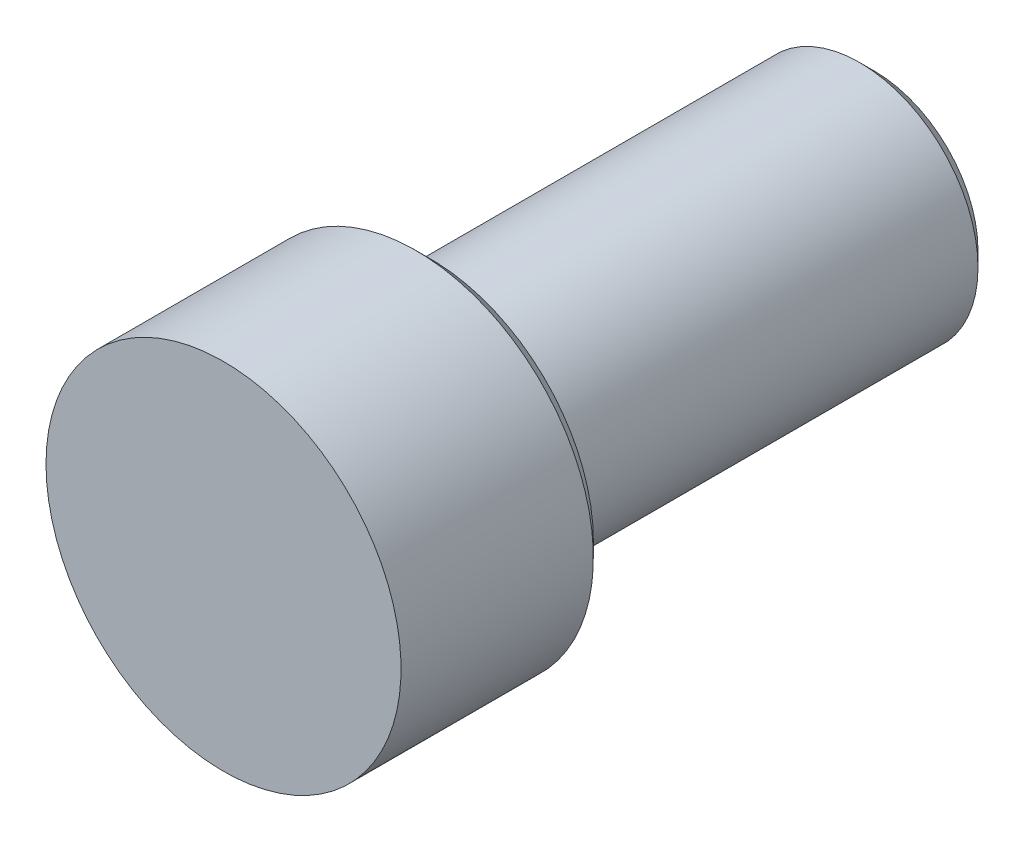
ISO-10303-21;
HEADER;
FILE_DESCRIPTION(('STEP AP214'),'2;1');
FILE_NAME('part.step','',(''),(''),'','','');
FILE_SCHEMA(('AUTOMOTIVE_DESIGN { 1 0 10303 214 1 1 1 1 }'));
ENDSEC;
DATA;
#1=APPLICATION_CONTEXT('core data for automotive mechanical design processes');
#2=APPLICATION_PROTOCOL_DEFINITION('international standard','automotive_design',2000,#1);
#3=PRODUCT_CONTEXT('',#1,'mechanical');
#4=PRODUCT('Part','Part','',(#3));
#5=PRODUCT_RELATED_PRODUCT_CATEGORY('part','',(#4));
#6=PRODUCT_DEFINITION_FORMATION('','',#4);
#7=PRODUCT_DEFINITION_CONTEXT('part definition',#1,'design');
#8=PRODUCT_DEFINITION('design','',#6,#7);
#9=PRODUCT_DEFINITION_SHAPE('','',#8);
#10=(LENGTH_UNIT() NAMED_UNIT(*) SI_UNIT(.MILLI.,.METRE.));
#11=(NAMED_UNIT(*) PLANE_ANGLE_UNIT() SI_UNIT($,.RADIAN.));
#12=(NAMED_UNIT(*) SI_UNIT($,.STERADIAN.) SOLID_ANGLE_UNIT());
#13=UNCERTAINTY_MEASURE_WITH_UNIT(LENGTH_MEASURE(1.E-05),#10,'distance_accuracy_value','');
#14=(GEOMETRIC_REPRESENTATION_CONTEXT(3) GLOBAL_UNCERTAINTY_ASSIGNED_CONTEXT((#13)) GLOBAL_UNIT_ASSIGNED_CONTEXT((#10,
#11,#12)) REPRESENTATION_CONTEXT('',''));
#15=CARTESIAN_POINT('',(0.,0.,0.));
#16=DIRECTION('',(0.,0.,1.));
#17=DIRECTION('',(1.,0.,0.));
#18=AXIS2_PLACEMENT_3D('',#15,#16,#17);
#19=CARTESIAN_POINT('',(341.592830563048,136.9952469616,-294.507999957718));
#20=DIRECTION('',(0.,0.,1.));
#21=DIRECTION('',(1.,0.,0.));
#22=AXIS2_PLACEMENT_3D('',#19,#20,#21);
#23=CYLINDRICAL_SURFACE('',#22,6.34999999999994);
#24=CARTESIAN_POINT('',(341.592830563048,136.9952469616,-293.714249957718));
#25=DIRECTION('',(0.,0.,-1.));
#26=DIRECTION('',(-1.,0.,0.));
#27=AXIS2_PLACEMENT_3D('',#24,#25,#26);
#28=CIRCLE('',#27,6.34999999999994);
#29=CARTESIAN_POINT('',(335.242830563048,136.9952469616,-293.714249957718));
#30=VERTEX_POINT('',#29);
#31=EDGE_CURVE('E44',#30,#30,#28,.F.);
#32=ORIENTED_EDGE('',*,*,#31,.T.);
#33=EDGE_LOOP('',(#32));
#34=FACE_BOUND('',#33,.T.);
#35=CARTESIAN_POINT('',(341.592830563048,136.9952469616,-270.695499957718));
#36=DIRECTION('',(0.,0.,-1.));
#37=DIRECTION('',(-1.,0.,0.));
#38=AXIS2_PLACEMENT_3D('',#35,#36,#37);
#39=CIRCLE('',#38,6.34999999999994);
#40=CARTESIAN_POINT('',(335.242830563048,136.9952469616,-270.695499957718));
#41=VERTEX_POINT('',#40);
#42=EDGE_CURVE('E53',#41,#41,#39,.T.);
#43=ORIENTED_EDGE('',*,*,#42,.T.);
#44=EDGE_LOOP('',(#43));
#45=FACE_BOUND('',#44,.T.);
#46=ADVANCED_FACE('F33',(#34,#45),#23,.T.);
#47=CARTESIAN_POINT('',(341.592830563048,136.9952469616,-294.507999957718));
#48=DIRECTION('',(0.,0.,-1.));
#49=DIRECTION('',(-1.,0.,0.));
#50=AXIS2_PLACEMENT_3D('',#47,#48,#49);
#51=PLANE('',#50);
#52=CARTESIAN_POINT('',(341.592830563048,136.9952469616,-294.507999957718));
#53=DIRECTION('',(0.,0.,-1.));
#54=DIRECTION('',(-1.,0.,0.));
#55=AXIS2_PLACEMENT_3D('',#52,#53,#54);
#56=CIRCLE('',#55,5.55624999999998);
#57=CARTESIAN_POINT('',(336.036580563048,136.9952469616,-294.507999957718));
#58=VERTEX_POINT('',#57);
#59=EDGE_CURVE('E48',#58,#58,#56,.T.);
#60=ORIENTED_EDGE('',*,*,#59,.T.);
#61=EDGE_LOOP('',(#60));
#62=FACE_BOUND('',#61,.T.);
#63=ADVANCED_FACE('F76',(#62),#51,.T.);
#64=CARTESIAN_POINT('',(341.592830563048,136.9952469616,-270.695499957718));
#65=DIRECTION('',(0.,0.,-1.));
#66=DIRECTION('',(-1.,0.,0.));
#67=AXIS2_PLACEMENT_3D('',#64,#65,#66);
#68=PLANE('',#67);
#69=CARTESIAN_POINT('',(341.592830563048,136.9952469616,-270.695499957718));
#70=DIRECTION('',(0.,0.,-1.));
#71=DIRECTION('',(-1.,0.,0.));
#72=AXIS2_PLACEMENT_3D('',#69,#70,#71);
#73=CIRCLE('',#72,8.73125000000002);
#74=CARTESIAN_POINT('',(332.861580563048,136.9952469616,-270.695499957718));
#75=VERTEX_POINT('',#74);
#76=EDGE_CURVE('E40',#75,#75,#73,.T.);
#77=ORIENTED_EDGE('',*,*,#76,.T.);
#78=EDGE_LOOP('',(#77));
#79=FACE_BOUND('',#78,.T.);
#80=ORIENTED_EDGE('',*,*,#42,.F.);
#81=EDGE_LOOP('',(#80));
#82=FACE_BOUND('',#81,.T.);
#83=ADVANCED_FACE('F71',(#79,#82),#68,.T.);
#84=CARTESIAN_POINT('',(341.592830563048,136.9952469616,-270.695499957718));
#85=DIRECTION('',(0.,0.,1.));
#86=DIRECTION('',(1.,0.,0.));
#87=AXIS2_PLACEMENT_3D('',#84,#85,#86);
#88=CYLINDRICAL_SURFACE('',#87,9.52500000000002);
#89=CARTESIAN_POINT('',(341.592830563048,136.9952469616,-269.901749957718));
#90=DIRECTION('',(0.,0.,-1.));
#91=DIRECTION('',(-1.,0.,0.));
#92=AXIS2_PLACEMENT_3D('',#89,#90,#91);
#93=CIRCLE('',#92,9.52500000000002);
#94=CARTESIAN_POINT('',(332.067830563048,136.9952469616,-269.901749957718));
#95=VERTEX_POINT('',#94);
#96=EDGE_CURVE('E10',#95,#95,#93,.F.);
#97=ORIENTED_EDGE('',*,*,#96,.T.);
#98=EDGE_LOOP('',(#97));
#99=FACE_BOUND('',#98,.T.);
#100=CARTESIAN_POINT('',(341.592830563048,136.9952469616,-259.582999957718));
#101=DIRECTION('',(0.,0.,-1.));
#102=DIRECTION('',(-1.,0.,0.));
#103=AXIS2_PLACEMENT_3D('',#100,#101,#102);
#104=CIRCLE('',#103,9.52500000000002);
#105=CARTESIAN_POINT('',(332.067830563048,136.9952469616,-259.582999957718));
#106=VERTEX_POINT('',#105);
#107=EDGE_CURVE('E56',#106,#106,#104,.T.);
#108=ORIENTED_EDGE('',*,*,#107,.T.);
#109=EDGE_LOOP('',(#108));
#110=FACE_BOUND('',#109,.T.);
#111=ADVANCED_FACE('F60',(#99,#110),#88,.T.);
#112=CARTESIAN_POINT('',(341.592830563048,136.9952469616,-259.582999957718));
#113=DIRECTION('',(0.,0.,-1.));
#114=DIRECTION('',(-1.,0.,0.));
#115=AXIS2_PLACEMENT_3D('',#112,#113,#114);
#116=PLANE('',#115);
#117=ORIENTED_EDGE('',*,*,#107,.F.);
#118=EDGE_LOOP('',(#117));
#119=FACE_BOUND('',#118,.T.);
#120=ADVANCED_FACE('F62',(#119),#116,.F.);
#121=CARTESIAN_POINT('',(341.592830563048,136.9952469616,-294.507999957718));
#122=DIRECTION('',(0.,0.,1.));
#123=DIRECTION('',(1.,0.,0.));
#124=AXIS2_PLACEMENT_3D('',#121,#122,#123);
#125=CONICAL_SURFACE('',#124,5.55624999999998,0.785398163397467);
#126=ORIENTED_EDGE('',*,*,#31,.F.);
#127=EDGE_LOOP('',(#126));
#128=FACE_BOUND('',#127,.T.);
#129=ORIENTED_EDGE('',*,*,#59,.F.);
#130=EDGE_LOOP('',(#129));
#131=FACE_BOUND('',#130,.T.);
#132=ADVANCED_FACE('F64',(#128,#131),#125,.T.);
#133=CARTESIAN_POINT('',(341.592830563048,136.9952469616,-270.695499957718));
#134=DIRECTION('',(0.,0.,1.));
#135=DIRECTION('',(1.,0.,0.));
#136=AXIS2_PLACEMENT_3D('',#133,#134,#135);
#137=CONICAL_SURFACE('',#136,8.73125000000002,0.785398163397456);
#138=ORIENTED_EDGE('',*,*,#96,.F.);
#139=EDGE_LOOP('',(#138));
#140=FACE_BOUND('',#139,.T.);
#141=ORIENTED_EDGE('',*,*,#76,.F.);
#142=EDGE_LOOP('',(#141));
#143=FACE_BOUND('',#142,.T.);
#144=ADVANCED_FACE('F35',(#140,#143),#137,.T.);
#145=CLOSED_SHELL('',(#46,#63,#83,#111,#120,#132,#144));
#146=MANIFOLD_SOLID_BREP('B2',#145);
#147=ADVANCED_BREP_SHAPE_REPRESENTATION('',(#18,#146),#14);
#148=SHAPE_DEFINITION_REPRESENTATION(#9,#147);
ENDSEC;
END-ISO-10303-21;
